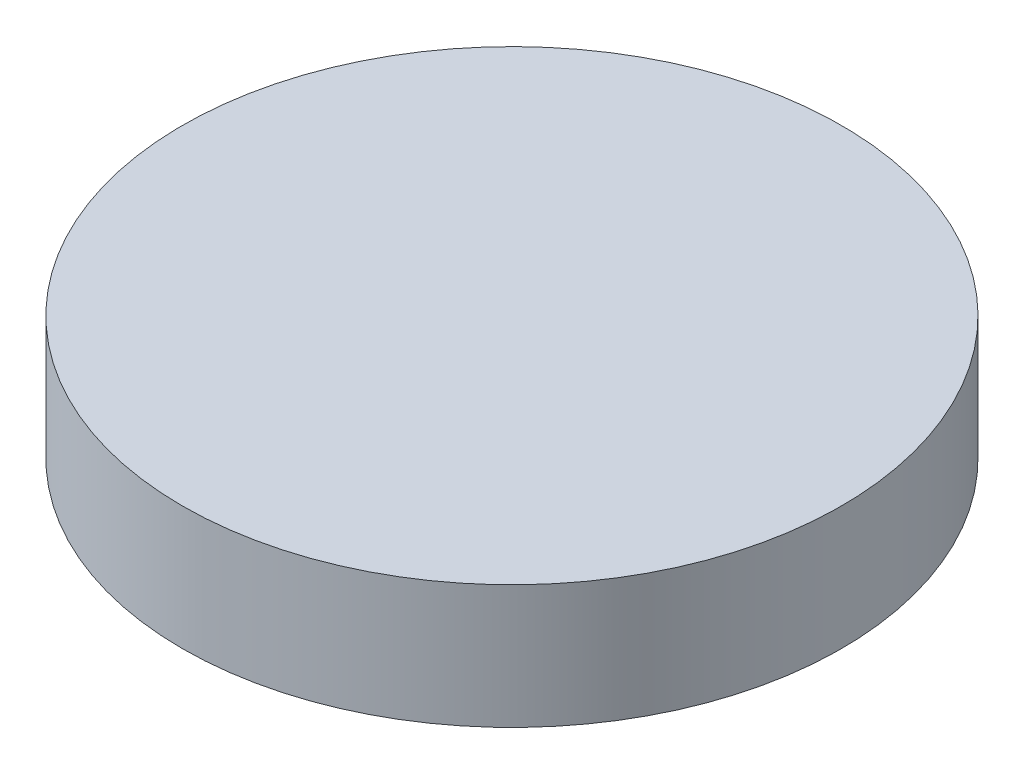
from build123d import *

# Parameters (mm, degrees)
SKETCH1_R           = 40
BOSS_EXTRUDE1_DEPTH = 15


with BuildPart() as part:
    # Sketch1 → Boss-Extrude1 (new body)
    with BuildSketch(Plane(origin=(0, 0, 0), x_dir=(1, 0, 0), z_dir=(0, 1, 0))):
        with Locations(Location((0, 0, 0), (0, 0, 270))):
            Circle(SKETCH1_R)
    extrude(amount=BOSS_EXTRUDE1_DEPTH)


solid = part.part
